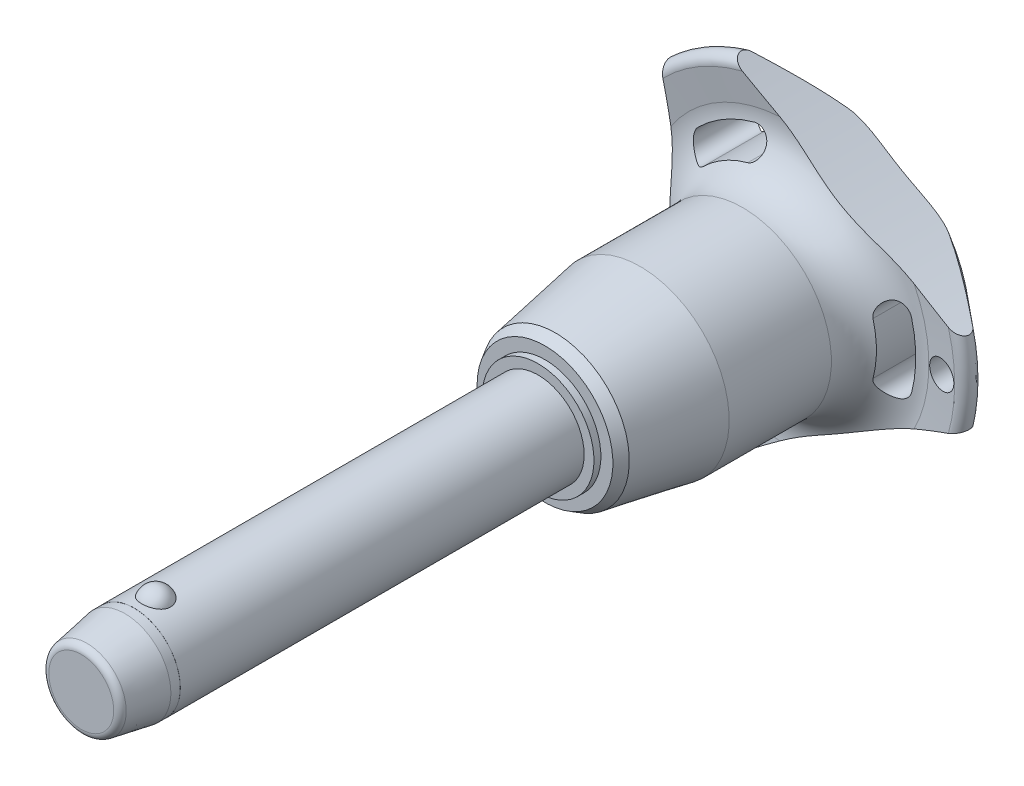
from build123d import *

# Parameters (mm, degrees)
SKETCH1_R           = 5
BOSS_EXTRUDE1_DEPTH = 40
SKETCH2_R           = 4.25
BOSS_EXTRUDE2_DEPTH = 33.3
BOSS_EXTRUDE3_START = 9.6
SKETCH1_2_R         = 5
BOSS_EXTRUDE3_DEPTH = 9.6
CHAMFER1_SIZE       = 4.8
CHAMFER1_SIZE2      = 0.846369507
FILLET1_R           = 0.75
SKETCH6_R           = 102.8
CUT_EXTRUDE1_DEPTH  = 79.369242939
CIRPATTERN1_COUNT   = 3
SKETCH7_R           = 1.5
CUT_EXTRUDE2_DEPTH  = 79.162591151
SKETCH8_R           = 5
SKETCH8_R_2         = 4.99
CUT_EXTRUDE3_DEPTH  = 5.76


with BuildPart() as part:
    # Sketch1 → Boss-Extrude1 (new body)
    with BuildSketch(Plane.XY):
        Circle(SKETCH1_R)
    extrude(amount=-BOSS_EXTRUDE1_DEPTH)

    # Sketch2 → Boss-Extrude2 (add)
    with BuildSketch(Plane(origin=(0, 0, -40), x_dir=(-1, 0, 0), z_dir=(0, 0, -1))):
        Circle(SKETCH2_R)
    extrude(amount=BOSS_EXTRUDE2_DEPTH)

    # Sketch3 → Revolve1 (revolve)
    with BuildSketch(Plane(origin=(0, 0, 0), x_dir=(0, 0, -1), z_dir=(1, 0, 0))):
        with BuildLine():
            Line((-1.516575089, 6), (-1.516575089, 2.7))
            ThreePointArc((-1.516575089, 2.7), (0.133424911, 4.35), (-1.516575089, 6))
        make_face()
        with BuildLine():
            Line((-1.516575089, -2.7), (-1.516575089, -6))
            ThreePointArc((-1.516575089, -6), (0.133424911, -4.35), (-1.516575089, -2.7))
        make_face()
    revolve(axis=Axis((0, -2.7, 1.516575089), (0, 1, 0)))

    # Sketch1_2 → Boss-Extrude3 (add)
    with BuildSketch(Plane.XY.offset(BOSS_EXTRUDE3_START)):
        Circle(SKETCH1_2_R)
    extrude(amount=-BOSS_EXTRUDE3_DEPTH)

    # Chamfer1
    chamfer1_edges = [part.edges().sort_by_distance(p)[0] for p in [
        (-5, 0, 9.6),
    ]]
    chamfer1_side = [part.faces().sort_by_distance(p)[0] for p in [
        (-5, 0, -15.2),
    ]]
    chamfer(chamfer1_edges, length=CHAMFER1_SIZE, length2=CHAMFER1_SIZE2, reference=chamfer1_side[0])

    # Fillet1
    fillet1_edges = [part.edges().sort_by_distance(p)[0] for p in [
        (-4.153630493, 0, 9.6),
        (4.25, 0, -73.3),
    ]]
    fillet(fillet1_edges, radius=FILLET1_R)

    # Sketch4 → Revolve2 (revolve)
    with BuildSketch(Plane(origin=(0, 0, 0), x_dir=(0, 0, -1), z_dir=(1, 0, 0)), mode=Mode.PRIVATE) as revolve2_sk:
        Polygon((40, 0), (40, 6.067402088), (40.75, 6.067402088), (40.75, 7.371950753), (41.879772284, 8.024225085), (51.1, 9.65), (62.2, 9.65), (62.2, 0), align=None)
    revolve(revolve2_sk.sketch.rotate(Axis((0, 0, -62.2), (0, 0, 1)), 90), axis=Axis((0, 0, -62.2), (0, 0, 1)))

    # Sketch5 → Revolve3 (revolve)
    with BuildSketch(Plane(origin=(0, 0, 0), x_dir=(0, 0, -1), z_dir=(1, 0, 0)), mode=Mode.PRIVATE) as revolve3_sk:
        with BuildLine():
            Line((67.16082631, 15.274661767), (66.757834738, 18.475067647))
            ThreePointArc((66.757834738, 18.475067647), (67.349836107, 19.516443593), (68.516044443, 19.24278761))
            Line((68.516044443, 19.24278761), (72.835691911, 14.094832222))
            ThreePointArc((72.835691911, 14.094832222), (73.3, 12.689260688), (72.67067517, 11.349423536))
            ThreePointArc((72.67067517, 11.349423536), (69.033110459, 6.185112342), (67.75, 0))
            Line((67.75, 0), (62.2, 0))
            Line((62.2, 0), (62.2, 9.65))
            ThreePointArc((62.2, 9.65), (65.949887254, 11.342683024), (67.16082631, 15.274661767))
        make_face()
    revolve(revolve3_sk.sketch.rotate(Axis((0, 0, -67.75), (0, 0, 1)), 90), axis=Axis((0, 0, -67.75), (0, 0, 1)))

    # Sketch6 → Cut-Extrude1 (cut, through all)
    with BuildSketch(Plane.XY):
        with Locations((-115.2, 0)):
            Circle(SKETCH6_R)
        with BuildLine():
            ThreePointArc((13.411913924, -3.529271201), (13.868496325, 0), (13.411913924, 3.529271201))
            ThreePointArc((13.411913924, 3.529271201), (11.694200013, 4.531299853), (10.692171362, 2.813585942))
            ThreePointArc((10.692171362, 2.813585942), (11.056165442, 0), (10.692171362, -2.813585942))
            ThreePointArc((10.692171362, -2.813585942), (11.694200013, -4.531299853), (13.411913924, -3.529271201))
        make_face()
    cut_extrude1 = extrude(amount=-CUT_EXTRUDE1_DEPTH, mode=Mode.SUBTRACT)

    # CirPattern1: Cut-Extrude1 ×3 about axis
    cirpattern1_axis = Axis((0, 0, 0), (0, 0, 1))
    for i in range(1, CIRPATTERN1_COUNT):
        add(cut_extrude1.rotate(cirpattern1_axis, i * 360 / CIRPATTERN1_COUNT), mode=Mode.SUBTRACT)

    # Sketch7 → Cut-Extrude2 (cut, through all)
    with BuildSketch(Plane.XY):
        with Locations(Location((16.868496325, 0, 0), (0, 0, 225.467095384))):
            Circle(SKETCH7_R)
    extrude(amount=-CUT_EXTRUDE2_DEPTH, mode=Mode.SUBTRACT)

    # Sketch8 → Cut-Extrude3 (cut)
    with BuildSketch(Plane.XY.offset(9.6)):
        Circle(SKETCH8_R)
        Circle(SKETCH8_R_2, mode=Mode.SUBTRACT)
    extrude(amount=-CUT_EXTRUDE3_DEPTH, mode=Mode.SUBTRACT)


solid = part.part
